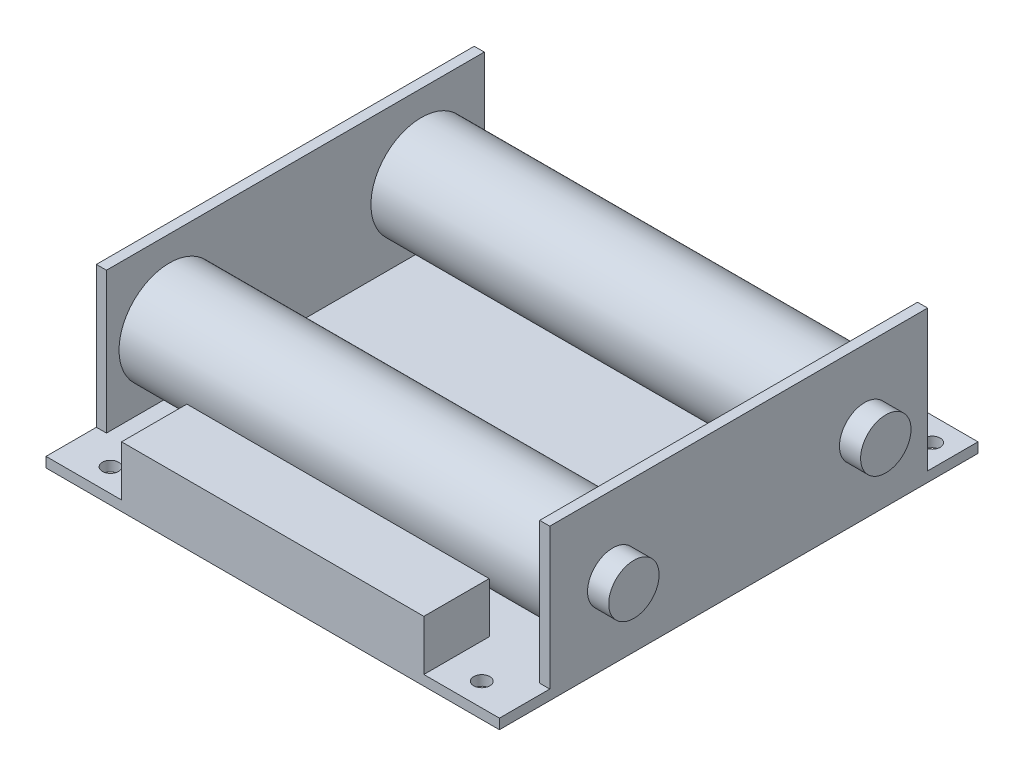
ISO-10303-21;
HEADER;
FILE_DESCRIPTION(('STEP AP214'),'2;1');
FILE_NAME('part.step','',(''),(''),'','','');
FILE_SCHEMA(('AUTOMOTIVE_DESIGN { 1 0 10303 214 1 1 1 1 }'));
ENDSEC;
DATA;
#1=APPLICATION_CONTEXT('core data for automotive mechanical design processes');
#2=APPLICATION_PROTOCOL_DEFINITION('international standard','automotive_design',2000,#1);
#3=PRODUCT_CONTEXT('',#1,'mechanical');
#4=PRODUCT('Part','Part','',(#3));
#5=PRODUCT_RELATED_PRODUCT_CATEGORY('part','',(#4));
#6=PRODUCT_DEFINITION_FORMATION('','',#4);
#7=PRODUCT_DEFINITION_CONTEXT('part definition',#1,'design');
#8=PRODUCT_DEFINITION('design','',#6,#7);
#9=PRODUCT_DEFINITION_SHAPE('','',#8);
#10=(LENGTH_UNIT() NAMED_UNIT(*) SI_UNIT(.MILLI.,.METRE.));
#11=(NAMED_UNIT(*) PLANE_ANGLE_UNIT() SI_UNIT($,.RADIAN.));
#12=(NAMED_UNIT(*) SI_UNIT($,.STERADIAN.) SOLID_ANGLE_UNIT());
#13=UNCERTAINTY_MEASURE_WITH_UNIT(LENGTH_MEASURE(1.E-05),#10,'distance_accuracy_value','');
#14=(GEOMETRIC_REPRESENTATION_CONTEXT(3) GLOBAL_UNCERTAINTY_ASSIGNED_CONTEXT((#13)) GLOBAL_UNIT_ASSIGNED_CONTEXT((#10,
#11,#12)) REPRESENTATION_CONTEXT('',''));
#15=CARTESIAN_POINT('',(0.,0.,0.));
#16=DIRECTION('',(0.,0.,1.));
#17=DIRECTION('',(1.,0.,0.));
#18=AXIS2_PLACEMENT_3D('',#15,#16,#17);
#19=CARTESIAN_POINT('',(-49.2,15.,25.));
#20=DIRECTION('',(1.,0.,0.));
#21=DIRECTION('',(0.,0.,-1.));
#22=AXIS2_PLACEMENT_3D('',#19,#20,#21);
#23=CYLINDRICAL_SURFACE('',#22,10.);
#24=CARTESIAN_POINT('',(43.,15.,25.));
#25=DIRECTION('',(1.,0.,0.));
#26=DIRECTION('',(0.,0.,-1.));
#27=AXIS2_PLACEMENT_3D('',#24,#25,#26);
#28=CIRCLE('',#27,10.);
#29=CARTESIAN_POINT('',(43.,15.,15.));
#30=VERTEX_POINT('',#29);
#31=EDGE_CURVE('E11',#30,#30,#28,.F.);
#32=ORIENTED_EDGE('',*,*,#31,.T.);
#33=EDGE_LOOP('',(#32));
#34=FACE_BOUND('',#33,.T.);
#35=CARTESIAN_POINT('',(-43.,15.,25.));
#36=DIRECTION('',(1.,0.,0.));
#37=DIRECTION('',(0.,0.,-1.));
#38=AXIS2_PLACEMENT_3D('',#35,#36,#37);
#39=CIRCLE('',#38,10.);
#40=CARTESIAN_POINT('',(-43.,15.,15.));
#41=VERTEX_POINT('',#40);
#42=EDGE_CURVE('E47',#41,#41,#39,.T.);
#43=ORIENTED_EDGE('',*,*,#42,.T.);
#44=EDGE_LOOP('',(#43));
#45=FACE_BOUND('',#44,.T.);
#46=ADVANCED_FACE('F46',(#34,#45),#23,.T.);
#47=OPEN_SHELL('',(#46));
#48=SHELL_BASED_SURFACE_MODEL('B2',(#47));
#49=CARTESIAN_POINT('',(-49.2,15.,-25.));
#50=DIRECTION('',(1.,0.,0.));
#51=DIRECTION('',(0.,0.,-1.));
#52=AXIS2_PLACEMENT_3D('',#49,#50,#51);
#53=CYLINDRICAL_SURFACE('',#52,10.);
#54=CARTESIAN_POINT('',(43.,15.,-25.));
#55=DIRECTION('',(1.,0.,0.));
#56=DIRECTION('',(0.,0.,-1.));
#57=AXIS2_PLACEMENT_3D('',#54,#55,#56);
#58=CIRCLE('',#57,10.);
#59=CARTESIAN_POINT('',(43.,15.,-35.));
#60=VERTEX_POINT('',#59);
#61=EDGE_CURVE('E86',#60,#60,#58,.F.);
#62=ORIENTED_EDGE('',*,*,#61,.T.);
#63=EDGE_LOOP('',(#62));
#64=FACE_BOUND('',#63,.T.);
#65=CARTESIAN_POINT('',(-43.,15.,-25.));
#66=DIRECTION('',(1.,0.,0.));
#67=DIRECTION('',(0.,0.,-1.));
#68=AXIS2_PLACEMENT_3D('',#65,#66,#67);
#69=CIRCLE('',#68,10.);
#70=CARTESIAN_POINT('',(-43.,15.,-35.));
#71=VERTEX_POINT('',#70);
#72=EDGE_CURVE('E45',#71,#71,#69,.T.);
#73=ORIENTED_EDGE('',*,*,#72,.T.);
#74=EDGE_LOOP('',(#73));
#75=FACE_BOUND('',#74,.T.);
#76=ADVANCED_FACE('F82',(#64,#75),#53,.T.);
#77=OPEN_SHELL('',(#76));
#78=SHELL_BASED_SURFACE_MODEL('B6',(#77));
#79=CARTESIAN_POINT('',(0.,2.,0.));
#80=DIRECTION('',(0.,-1.,0.));
#81=DIRECTION('',(0.,0.,-1.));
#82=AXIS2_PLACEMENT_3D('',#79,#80,#81);
#83=PLANE('',#82);
#84=CARTESIAN_POINT('',(-36.8,2.,42.9));
#85=DIRECTION('',(0.,-1.,0.));
#86=DIRECTION('',(0.,0.,-1.));
#87=AXIS2_PLACEMENT_3D('',#84,#85,#86);
#88=CIRCLE('',#87,1.6);
#89=CARTESIAN_POINT('',(-36.8,2.,41.3));
#90=VERTEX_POINT('',#89);
#91=EDGE_CURVE('E336',#90,#90,#88,.T.);
#92=ORIENTED_EDGE('',*,*,#91,.T.);
#93=EDGE_LOOP('',(#92));
#94=FACE_BOUND('',#93,.T.);
#95=CARTESIAN_POINT('',(36.9,2.,42.9));
#96=DIRECTION('',(0.,-1.,0.));
#97=DIRECTION('',(0.,0.,-1.));
#98=AXIS2_PLACEMENT_3D('',#95,#96,#97);
#99=CIRCLE('',#98,1.6);
#100=CARTESIAN_POINT('',(36.9,2.,41.3));
#101=VERTEX_POINT('',#100);
#102=EDGE_CURVE('E342',#101,#101,#99,.T.);
#103=ORIENTED_EDGE('',*,*,#102,.T.);
#104=EDGE_LOOP('',(#103));
#105=FACE_BOUND('',#104,.T.);
#106=CARTESIAN_POINT('',(40.6,2.,-42.8));
#107=DIRECTION('',(0.,-1.,0.));
#108=DIRECTION('',(0.,0.,-1.));
#109=AXIS2_PLACEMENT_3D('',#106,#107,#108);
#110=CIRCLE('',#109,1.6);
#111=CARTESIAN_POINT('',(40.6,2.,-44.4));
#112=VERTEX_POINT('',#111);
#113=EDGE_CURVE('E348',#112,#112,#110,.T.);
#114=ORIENTED_EDGE('',*,*,#113,.T.);
#115=EDGE_LOOP('',(#114));
#116=FACE_BOUND('',#115,.T.);
#117=CARTESIAN_POINT('',(-39.4,2.,-42.8));
#118=DIRECTION('',(0.,-1.,0.));
#119=DIRECTION('',(0.,0.,-1.));
#120=AXIS2_PLACEMENT_3D('',#117,#118,#119);
#121=CIRCLE('',#120,1.6);
#122=CARTESIAN_POINT('',(-39.4,2.,-44.4));
#123=VERTEX_POINT('',#122);
#124=EDGE_CURVE('E354',#123,#123,#121,.T.);
#125=ORIENTED_EDGE('',*,*,#124,.T.);
#126=EDGE_LOOP('',(#125));
#127=FACE_BOUND('',#126,.T.);
#128=DIRECTION('',(0.,0.,1.));
#129=VECTOR('',#128,1.);
#130=CARTESIAN_POINT('',(-30.,2.,34.5));
#131=LINE('',#130,#129);
#132=CARTESIAN_POINT('',(-30.,2.,34.5));
#133=VERTEX_POINT('',#132);
#134=CARTESIAN_POINT('',(-30.,2.,47.5));
#135=VERTEX_POINT('',#134);
#136=EDGE_CURVE('E125',#133,#135,#131,.T.);
#137=ORIENTED_EDGE('',*,*,#136,.F.);
#138=DIRECTION('',(-1.,0.,0.));
#139=VECTOR('',#138,1.);
#140=CARTESIAN_POINT('',(-30.,2.,34.5));
#141=LINE('',#140,#139);
#142=CARTESIAN_POINT('',(30.,2.,34.5));
#143=VERTEX_POINT('',#142);
#144=EDGE_CURVE('E129',#143,#133,#141,.T.);
#145=ORIENTED_EDGE('',*,*,#144,.F.);
#146=DIRECTION('',(0.,0.,-1.));
#147=VECTOR('',#146,1.);
#148=CARTESIAN_POINT('',(30.,2.,34.5));
#149=LINE('',#148,#147);
#150=CARTESIAN_POINT('',(30.,2.,47.5));
#151=VERTEX_POINT('',#150);
#152=EDGE_CURVE('E760',#151,#143,#149,.T.);
#153=ORIENTED_EDGE('',*,*,#152,.F.);
#154=DIRECTION('',(1.,0.,0.));
#155=VECTOR('',#154,1.);
#156=CARTESIAN_POINT('',(45.,2.,47.5));
#157=LINE('',#156,#155);
#158=CARTESIAN_POINT('',(45.,2.,47.5));
#159=VERTEX_POINT('',#158);
#160=EDGE_CURVE('E360',#151,#159,#157,.T.);
#161=ORIENTED_EDGE('',*,*,#160,.T.);
#162=DIRECTION('',(0.,0.,-1.));
#163=VECTOR('',#162,1.);
#164=CARTESIAN_POINT('',(45.,2.,-47.5));
#165=LINE('',#164,#163);
#166=CARTESIAN_POINT('',(45.,2.,37.5));
#167=VERTEX_POINT('',#166);
#168=EDGE_CURVE('E365',#159,#167,#165,.T.);
#169=ORIENTED_EDGE('',*,*,#168,.T.);
#170=DIRECTION('',(-1.,0.,0.));
#171=VECTOR('',#170,1.);
#172=CARTESIAN_POINT('',(0.,2.,37.5));
#173=LINE('',#172,#171);
#174=CARTESIAN_POINT('',(43.,2.,37.5));
#175=VERTEX_POINT('',#174);
#176=EDGE_CURVE('E331',#167,#175,#173,.T.);
#177=ORIENTED_EDGE('',*,*,#176,.T.);
#178=DIRECTION('',(0.,0.,-1.));
#179=VECTOR('',#178,1.);
#180=CARTESIAN_POINT('',(43.,2.,0.));
#181=LINE('',#180,#179);
#182=CARTESIAN_POINT('',(43.,2.,-37.5));
#183=VERTEX_POINT('',#182);
#184=EDGE_CURVE('E324',#175,#183,#181,.T.);
#185=ORIENTED_EDGE('',*,*,#184,.T.);
#186=DIRECTION('',(1.,0.,0.));
#187=VECTOR('',#186,1.);
#188=CARTESIAN_POINT('',(0.,2.,-37.5));
#189=LINE('',#188,#187);
#190=CARTESIAN_POINT('',(45.,2.,-37.5));
#191=VERTEX_POINT('',#190);
#192=EDGE_CURVE('E328',#183,#191,#189,.T.);
#193=ORIENTED_EDGE('',*,*,#192,.T.);
#194=CARTESIAN_POINT('',(45.,2.,-47.5));
#195=VERTEX_POINT('',#194);
#196=EDGE_CURVE('E364',#191,#195,#165,.T.);
#197=ORIENTED_EDGE('',*,*,#196,.T.);
#198=DIRECTION('',(-1.,0.,0.));
#199=VECTOR('',#198,1.);
#200=CARTESIAN_POINT('',(45.,2.,-47.5));
#201=LINE('',#200,#199);
#202=CARTESIAN_POINT('',(-45.,2.,-47.5));
#203=VERTEX_POINT('',#202);
#204=EDGE_CURVE('E367',#195,#203,#201,.T.);
#205=ORIENTED_EDGE('',*,*,#204,.T.);
#206=DIRECTION('',(0.,0.,1.));
#207=VECTOR('',#206,1.);
#208=CARTESIAN_POINT('',(-45.,2.,-47.5));
#209=LINE('',#208,#207);
#210=CARTESIAN_POINT('',(-45.,2.,-37.5));
#211=VERTEX_POINT('',#210);
#212=EDGE_CURVE('E358',#203,#211,#209,.T.);
#213=ORIENTED_EDGE('',*,*,#212,.T.);
#214=DIRECTION('',(-1.,0.,0.));
#215=VECTOR('',#214,1.);
#216=CARTESIAN_POINT('',(0.,2.,-37.5));
#217=LINE('',#216,#215);
#218=CARTESIAN_POINT('',(-43.,2.,-37.5));
#219=VERTEX_POINT('',#218);
#220=EDGE_CURVE('E299',#219,#211,#217,.T.);
#221=ORIENTED_EDGE('',*,*,#220,.F.);
#222=DIRECTION('',(0.,0.,1.));
#223=VECTOR('',#222,1.);
#224=CARTESIAN_POINT('',(-43.,2.,0.));
#225=LINE('',#224,#223);
#226=CARTESIAN_POINT('',(-43.,2.,37.5));
#227=VERTEX_POINT('',#226);
#228=EDGE_CURVE('E295',#219,#227,#225,.T.);
#229=ORIENTED_EDGE('',*,*,#228,.T.);
#230=DIRECTION('',(1.,0.,0.));
#231=VECTOR('',#230,1.);
#232=CARTESIAN_POINT('',(0.,2.,37.5));
#233=LINE('',#232,#231);
#234=CARTESIAN_POINT('',(-45.,2.,37.5));
#235=VERTEX_POINT('',#234);
#236=EDGE_CURVE('E302',#235,#227,#233,.T.);
#237=ORIENTED_EDGE('',*,*,#236,.F.);
#238=CARTESIAN_POINT('',(-45.,2.,47.5));
#239=VERTEX_POINT('',#238);
#240=EDGE_CURVE('E361',#235,#239,#209,.T.);
#241=ORIENTED_EDGE('',*,*,#240,.T.);
#242=EDGE_CURVE('E362',#239,#135,#157,.T.);
#243=ORIENTED_EDGE('',*,*,#242,.T.);
#244=EDGE_LOOP('',(#137,#145,#153,#161,#169,#177,#185,#193,#197,#205,#213,#221,#229,#237,#241,#243));
#245=FACE_BOUND('',#244,.T.);
#246=ADVANCED_FACE('F109',(#94,#105,#116,#127,#245),#83,.F.);
#247=CARTESIAN_POINT('',(-45.,2.,-47.5));
#248=DIRECTION('',(1.,0.,0.));
#249=DIRECTION('',(0.,0.,-1.));
#250=AXIS2_PLACEMENT_3D('',#247,#248,#249);
#251=PLANE('',#250);
#252=CARTESIAN_POINT('',(-45.,15.,-25.));
#253=DIRECTION('',(1.,0.,0.));
#254=DIRECTION('',(0.,0.,-1.));
#255=AXIS2_PLACEMENT_3D('',#252,#253,#254);
#256=CIRCLE('',#255,5.);
#257=CARTESIAN_POINT('',(-45.,15.,-30.));
#258=VERTEX_POINT('',#257);
#259=EDGE_CURVE('E258',#258,#258,#256,.T.);
#260=ORIENTED_EDGE('',*,*,#259,.T.);
#261=EDGE_LOOP('',(#260));
#262=FACE_BOUND('',#261,.T.);
#263=CARTESIAN_POINT('',(-45.,15.,25.));
#264=DIRECTION('',(1.,0.,0.));
#265=DIRECTION('',(0.,0.,-1.));
#266=AXIS2_PLACEMENT_3D('',#263,#264,#265);
#267=CIRCLE('',#266,5.);
#268=CARTESIAN_POINT('',(-45.,15.,20.));
#269=VERTEX_POINT('',#268);
#270=EDGE_CURVE('E274',#269,#269,#267,.T.);
#271=ORIENTED_EDGE('',*,*,#270,.T.);
#272=EDGE_LOOP('',(#271));
#273=FACE_BOUND('',#272,.T.);
#274=DIRECTION('',(0.,0.,1.));
#275=VECTOR('',#274,1.);
#276=CARTESIAN_POINT('',(-45.,0.,-47.5));
#277=LINE('',#276,#275);
#278=CARTESIAN_POINT('',(-45.,0.,-47.5));
#279=VERTEX_POINT('',#278);
#280=CARTESIAN_POINT('',(-45.,0.,47.5));
#281=VERTEX_POINT('',#280);
#282=EDGE_CURVE('E357',#279,#281,#277,.T.);
#283=ORIENTED_EDGE('',*,*,#282,.T.);
#284=DIRECTION('',(0.,-1.,0.));
#285=VECTOR('',#284,1.);
#286=CARTESIAN_POINT('',(-45.,2.,47.5));
#287=LINE('',#286,#285);
#288=EDGE_CURVE('E385',#239,#281,#287,.T.);
#289=ORIENTED_EDGE('',*,*,#288,.F.);
#290=ORIENTED_EDGE('',*,*,#240,.F.);
#291=DIRECTION('',(0.,-1.,0.));
#292=VECTOR('',#291,1.);
#293=CARTESIAN_POINT('',(-45.,0.,37.5));
#294=LINE('',#293,#292);
#295=CARTESIAN_POINT('',(-45.,30.,37.5));
#296=VERTEX_POINT('',#295);
#297=EDGE_CURVE('E277',#296,#235,#294,.T.);
#298=ORIENTED_EDGE('',*,*,#297,.F.);
#299=DIRECTION('',(0.,0.,1.));
#300=VECTOR('',#299,1.);
#301=CARTESIAN_POINT('',(-45.,30.,37.5));
#302=LINE('',#301,#300);
#303=CARTESIAN_POINT('',(-45.,30.,-37.5));
#304=VERTEX_POINT('',#303);
#305=EDGE_CURVE('E289',#304,#296,#302,.T.);
#306=ORIENTED_EDGE('',*,*,#305,.F.);
#307=DIRECTION('',(0.,1.,0.));
#308=VECTOR('',#307,1.);
#309=CARTESIAN_POINT('',(-45.,0.,-37.5));
#310=LINE('',#309,#308);
#311=EDGE_CURVE('E282',#211,#304,#310,.T.);
#312=ORIENTED_EDGE('',*,*,#311,.F.);
#313=ORIENTED_EDGE('',*,*,#212,.F.);
#314=DIRECTION('',(0.,-1.,0.));
#315=VECTOR('',#314,1.);
#316=CARTESIAN_POINT('',(-45.,2.,-47.5));
#317=LINE('',#316,#315);
#318=EDGE_CURVE('E369',#203,#279,#317,.T.);
#319=ORIENTED_EDGE('',*,*,#318,.T.);
#320=EDGE_LOOP('',(#283,#289,#290,#298,#306,#312,#313,#319));
#321=FACE_BOUND('',#320,.T.);
#322=ADVANCED_FACE('F111',(#262,#273,#321),#251,.F.);
#323=CARTESIAN_POINT('',(45.,2.,47.5));
#324=DIRECTION('',(0.,0.,-1.));
#325=DIRECTION('',(-1.,0.,0.));
#326=AXIS2_PLACEMENT_3D('',#323,#324,#325);
#327=PLANE('',#326);
#328=DIRECTION('',(1.,0.,0.));
#329=VECTOR('',#328,1.);
#330=CARTESIAN_POINT('',(45.,0.,47.5));
#331=LINE('',#330,#329);
#332=CARTESIAN_POINT('',(45.,0.,47.5));
#333=VERTEX_POINT('',#332);
#334=EDGE_CURVE('E371',#281,#333,#331,.T.);
#335=ORIENTED_EDGE('',*,*,#334,.T.);
#336=DIRECTION('',(0.,-1.,0.));
#337=VECTOR('',#336,1.);
#338=CARTESIAN_POINT('',(45.,2.,47.5));
#339=LINE('',#338,#337);
#340=EDGE_CURVE('E382',#159,#333,#339,.T.);
#341=ORIENTED_EDGE('',*,*,#340,.F.);
#342=ORIENTED_EDGE('',*,*,#160,.F.);
#343=DIRECTION('',(0.,-1.,0.));
#344=VECTOR('',#343,1.);
#345=CARTESIAN_POINT('',(30.,12.,47.5));
#346=LINE('',#345,#344);
#347=CARTESIAN_POINT('',(30.,12.,47.5));
#348=VERTEX_POINT('',#347);
#349=EDGE_CURVE('E229',#348,#151,#346,.T.);
#350=ORIENTED_EDGE('',*,*,#349,.F.);
#351=DIRECTION('',(1.,0.,0.));
#352=VECTOR('',#351,1.);
#353=CARTESIAN_POINT('',(-30.,12.,47.5));
#354=LINE('',#353,#352);
#355=CARTESIAN_POINT('',(-30.,12.,47.5));
#356=VERTEX_POINT('',#355);
#357=EDGE_CURVE('E222',#356,#348,#354,.T.);
#358=ORIENTED_EDGE('',*,*,#357,.F.);
#359=DIRECTION('',(0.,-1.,0.));
#360=VECTOR('',#359,1.);
#361=CARTESIAN_POINT('',(-30.,12.,47.5));
#362=LINE('',#361,#360);
#363=EDGE_CURVE('E227',#356,#135,#362,.T.);
#364=ORIENTED_EDGE('',*,*,#363,.T.);
#365=ORIENTED_EDGE('',*,*,#242,.F.);
#366=ORIENTED_EDGE('',*,*,#288,.T.);
#367=EDGE_LOOP('',(#335,#341,#342,#350,#358,#364,#365,#366));
#368=FACE_BOUND('',#367,.T.);
#369=ADVANCED_FACE('F224',(#368),#327,.F.);
#370=CARTESIAN_POINT('',(45.,2.,-47.5));
#371=DIRECTION('',(-1.,0.,0.));
#372=DIRECTION('',(0.,0.,1.));
#373=AXIS2_PLACEMENT_3D('',#370,#371,#372);
#374=PLANE('',#373);
#375=CARTESIAN_POINT('',(45.,15.,-25.));
#376=DIRECTION('',(-1.,0.,0.));
#377=DIRECTION('',(0.,0.,1.));
#378=AXIS2_PLACEMENT_3D('',#375,#376,#377);
#379=CIRCLE('',#378,5.);
#380=CARTESIAN_POINT('',(45.,15.,-20.));
#381=VERTEX_POINT('',#380);
#382=EDGE_CURVE('E254',#381,#381,#379,.T.);
#383=ORIENTED_EDGE('',*,*,#382,.T.);
#384=EDGE_LOOP('',(#383));
#385=FACE_BOUND('',#384,.T.);
#386=CARTESIAN_POINT('',(45.,15.,25.));
#387=DIRECTION('',(-1.,0.,0.));
#388=DIRECTION('',(0.,0.,1.));
#389=AXIS2_PLACEMENT_3D('',#386,#387,#388);
#390=CIRCLE('',#389,5.);
#391=CARTESIAN_POINT('',(45.,15.,30.));
#392=VERTEX_POINT('',#391);
#393=EDGE_CURVE('E267',#392,#392,#390,.T.);
#394=ORIENTED_EDGE('',*,*,#393,.T.);
#395=EDGE_LOOP('',(#394));
#396=FACE_BOUND('',#395,.T.);
#397=ORIENTED_EDGE('',*,*,#196,.F.);
#398=DIRECTION('',(0.,1.,0.));
#399=VECTOR('',#398,1.);
#400=CARTESIAN_POINT('',(45.,0.,-37.5));
#401=LINE('',#400,#399);
#402=CARTESIAN_POINT('',(45.,30.,-37.5));
#403=VERTEX_POINT('',#402);
#404=EDGE_CURVE('E318',#191,#403,#401,.T.);
#405=ORIENTED_EDGE('',*,*,#404,.T.);
#406=DIRECTION('',(0.,0.,1.));
#407=VECTOR('',#406,1.);
#408=CARTESIAN_POINT('',(45.,30.,37.5));
#409=LINE('',#408,#407);
#410=CARTESIAN_POINT('',(45.,30.,37.5));
#411=VERTEX_POINT('',#410);
#412=EDGE_CURVE('E310',#403,#411,#409,.T.);
#413=ORIENTED_EDGE('',*,*,#412,.T.);
#414=DIRECTION('',(0.,-1.,0.));
#415=VECTOR('',#414,1.);
#416=CARTESIAN_POINT('',(45.,0.,37.5));
#417=LINE('',#416,#415);
#418=EDGE_CURVE('E305',#411,#167,#417,.T.);
#419=ORIENTED_EDGE('',*,*,#418,.T.);
#420=ORIENTED_EDGE('',*,*,#168,.F.);
#421=ORIENTED_EDGE('',*,*,#340,.T.);
#422=DIRECTION('',(0.,0.,-1.));
#423=VECTOR('',#422,1.);
#424=CARTESIAN_POINT('',(45.,0.,-47.5));
#425=LINE('',#424,#423);
#426=CARTESIAN_POINT('',(45.,0.,-47.5));
#427=VERTEX_POINT('',#426);
#428=EDGE_CURVE('E373',#333,#427,#425,.T.);
#429=ORIENTED_EDGE('',*,*,#428,.T.);
#430=DIRECTION('',(0.,-1.,0.));
#431=VECTOR('',#430,1.);
#432=CARTESIAN_POINT('',(45.,2.,-47.5));
#433=LINE('',#432,#431);
#434=EDGE_CURVE('E379',#195,#427,#433,.T.);
#435=ORIENTED_EDGE('',*,*,#434,.F.);
#436=EDGE_LOOP('',(#397,#405,#413,#419,#420,#421,#429,#435));
#437=FACE_BOUND('',#436,.T.);
#438=ADVANCED_FACE('F427',(#385,#396,#437),#374,.F.);
#439=CARTESIAN_POINT('',(45.,2.,-47.5));
#440=DIRECTION('',(0.,0.,1.));
#441=DIRECTION('',(1.,0.,0.));
#442=AXIS2_PLACEMENT_3D('',#439,#440,#441);
#443=PLANE('',#442);
#444=DIRECTION('',(-1.,0.,0.));
#445=VECTOR('',#444,1.);
#446=CARTESIAN_POINT('',(45.,0.,-47.5));
#447=LINE('',#446,#445);
#448=EDGE_CURVE('E375',#427,#279,#447,.T.);
#449=ORIENTED_EDGE('',*,*,#448,.T.);
#450=ORIENTED_EDGE('',*,*,#318,.F.);
#451=ORIENTED_EDGE('',*,*,#204,.F.);
#452=ORIENTED_EDGE('',*,*,#434,.T.);
#453=EDGE_LOOP('',(#449,#450,#451,#452));
#454=FACE_BOUND('',#453,.T.);
#455=ADVANCED_FACE('F449',(#454),#443,.F.);
#456=CARTESIAN_POINT('',(0.,0.,0.));
#457=DIRECTION('',(0.,-1.,0.));
#458=DIRECTION('',(0.,0.,-1.));
#459=AXIS2_PLACEMENT_3D('',#456,#457,#458);
#460=PLANE('',#459);
#461=ORIENTED_EDGE('',*,*,#334,.F.);
#462=ORIENTED_EDGE('',*,*,#282,.F.);
#463=ORIENTED_EDGE('',*,*,#448,.F.);
#464=ORIENTED_EDGE('',*,*,#428,.F.);
#465=EDGE_LOOP('',(#461,#462,#463,#464));
#466=FACE_BOUND('',#465,.T.);
#467=CARTESIAN_POINT('',(-39.4,0.,-42.8));
#468=DIRECTION('',(0.,-1.,0.));
#469=DIRECTION('',(0.,0.,-1.));
#470=AXIS2_PLACEMENT_3D('',#467,#468,#469);
#471=CIRCLE('',#470,1.59999999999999);
#472=CARTESIAN_POINT('',(-39.4,0.,-44.4));
#473=VERTEX_POINT('',#472);
#474=EDGE_CURVE('E351',#473,#473,#471,.T.);
#475=ORIENTED_EDGE('',*,*,#474,.F.);
#476=EDGE_LOOP('',(#475));
#477=FACE_BOUND('',#476,.T.);
#478=CARTESIAN_POINT('',(40.6,0.,-42.8));
#479=DIRECTION('',(0.,-1.,0.));
#480=DIRECTION('',(0.,0.,-1.));
#481=AXIS2_PLACEMENT_3D('',#478,#479,#480);
#482=CIRCLE('',#481,1.59999999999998);
#483=CARTESIAN_POINT('',(40.6,0.,-44.4));
#484=VERTEX_POINT('',#483);
#485=EDGE_CURVE('E345',#484,#484,#482,.T.);
#486=ORIENTED_EDGE('',*,*,#485,.F.);
#487=EDGE_LOOP('',(#486));
#488=FACE_BOUND('',#487,.T.);
#489=CARTESIAN_POINT('',(36.9,0.,42.9));
#490=DIRECTION('',(0.,-1.,0.));
#491=DIRECTION('',(0.,0.,-1.));
#492=AXIS2_PLACEMENT_3D('',#489,#490,#491);
#493=CIRCLE('',#492,1.59999999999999);
#494=CARTESIAN_POINT('',(36.9,0.,41.3));
#495=VERTEX_POINT('',#494);
#496=EDGE_CURVE('E339',#495,#495,#493,.T.);
#497=ORIENTED_EDGE('',*,*,#496,.F.);
#498=EDGE_LOOP('',(#497));
#499=FACE_BOUND('',#498,.T.);
#500=CARTESIAN_POINT('',(-36.8,0.,42.9));
#501=DIRECTION('',(0.,-1.,0.));
#502=DIRECTION('',(0.,0.,-1.));
#503=AXIS2_PLACEMENT_3D('',#500,#501,#502);
#504=CIRCLE('',#503,1.59999999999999);
#505=CARTESIAN_POINT('',(-36.8,0.,41.3));
#506=VERTEX_POINT('',#505);
#507=EDGE_CURVE('E333',#506,#506,#504,.T.);
#508=ORIENTED_EDGE('',*,*,#507,.F.);
#509=EDGE_LOOP('',(#508));
#510=FACE_BOUND('',#509,.T.);
#511=ADVANCED_FACE('F422',(#466,#477,#488,#499,#510),#460,.T.);
#512=CARTESIAN_POINT('',(-39.4,0.,-42.8));
#513=DIRECTION('',(0.,-1.,0.));
#514=DIRECTION('',(0.,0.,-1.));
#515=AXIS2_PLACEMENT_3D('',#512,#513,#514);
#516=CYLINDRICAL_SURFACE('',#515,1.59999999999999);
#517=ORIENTED_EDGE('',*,*,#124,.F.);
#518=EDGE_LOOP('',(#517));
#519=FACE_BOUND('',#518,.T.);
#520=ORIENTED_EDGE('',*,*,#474,.T.);
#521=EDGE_LOOP('',(#520));
#522=FACE_BOUND('',#521,.T.);
#523=ADVANCED_FACE('F456',(#519,#522),#516,.F.);
#524=CARTESIAN_POINT('',(40.6,0.,-42.8));
#525=DIRECTION('',(0.,-1.,0.));
#526=DIRECTION('',(0.,0.,-1.));
#527=AXIS2_PLACEMENT_3D('',#524,#525,#526);
#528=CYLINDRICAL_SURFACE('',#527,1.59999999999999);
#529=ORIENTED_EDGE('',*,*,#113,.F.);
#530=EDGE_LOOP('',(#529));
#531=FACE_BOUND('',#530,.T.);
#532=ORIENTED_EDGE('',*,*,#485,.T.);
#533=EDGE_LOOP('',(#532));
#534=FACE_BOUND('',#533,.T.);
#535=ADVANCED_FACE('F471',(#531,#534),#528,.F.);
#536=CARTESIAN_POINT('',(36.9,0.,42.9));
#537=DIRECTION('',(0.,-1.,0.));
#538=DIRECTION('',(0.,0.,-1.));
#539=AXIS2_PLACEMENT_3D('',#536,#537,#538);
#540=CYLINDRICAL_SURFACE('',#539,1.59999999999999);
#541=ORIENTED_EDGE('',*,*,#102,.F.);
#542=EDGE_LOOP('',(#541));
#543=FACE_BOUND('',#542,.T.);
#544=ORIENTED_EDGE('',*,*,#496,.T.);
#545=EDGE_LOOP('',(#544));
#546=FACE_BOUND('',#545,.T.);
#547=ADVANCED_FACE('F475',(#543,#546),#540,.F.);
#548=CARTESIAN_POINT('',(-36.8,0.,42.9));
#549=DIRECTION('',(0.,-1.,0.));
#550=DIRECTION('',(0.,0.,-1.));
#551=AXIS2_PLACEMENT_3D('',#548,#549,#550);
#552=CYLINDRICAL_SURFACE('',#551,1.59999999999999);
#553=ORIENTED_EDGE('',*,*,#91,.F.);
#554=EDGE_LOOP('',(#553));
#555=FACE_BOUND('',#554,.T.);
#556=ORIENTED_EDGE('',*,*,#507,.T.);
#557=EDGE_LOOP('',(#556));
#558=FACE_BOUND('',#557,.T.);
#559=ADVANCED_FACE('F479',(#555,#558),#552,.F.);
#560=CARTESIAN_POINT('',(43.,0.,37.5));
#561=DIRECTION('',(0.,0.,1.));
#562=DIRECTION('',(1.,0.,0.));
#563=AXIS2_PLACEMENT_3D('',#560,#561,#562);
#564=PLANE('',#563);
#565=ORIENTED_EDGE('',*,*,#176,.F.);
#566=ORIENTED_EDGE('',*,*,#418,.F.);
#567=DIRECTION('',(1.,0.,0.));
#568=VECTOR('',#567,1.);
#569=CARTESIAN_POINT('',(43.,30.,37.5));
#570=LINE('',#569,#568);
#571=CARTESIAN_POINT('',(43.,30.,37.5));
#572=VERTEX_POINT('',#571);
#573=EDGE_CURVE('E322',#572,#411,#570,.T.);
#574=ORIENTED_EDGE('',*,*,#573,.F.);
#575=DIRECTION('',(0.,-1.,0.));
#576=VECTOR('',#575,1.);
#577=CARTESIAN_POINT('',(43.,0.,37.5));
#578=LINE('',#577,#576);
#579=EDGE_CURVE('E306',#572,#175,#578,.T.);
#580=ORIENTED_EDGE('',*,*,#579,.T.);
#581=EDGE_LOOP('',(#565,#566,#574,#580));
#582=FACE_BOUND('',#581,.T.);
#583=ADVANCED_FACE('F433',(#582),#564,.T.);
#584=CARTESIAN_POINT('',(43.,0.,-37.5));
#585=DIRECTION('',(0.,0.,-1.));
#586=DIRECTION('',(-1.,0.,0.));
#587=AXIS2_PLACEMENT_3D('',#584,#585,#586);
#588=PLANE('',#587);
#589=ORIENTED_EDGE('',*,*,#192,.F.);
#590=DIRECTION('',(0.,1.,0.));
#591=VECTOR('',#590,1.);
#592=CARTESIAN_POINT('',(43.,0.,-37.5));
#593=LINE('',#592,#591);
#594=CARTESIAN_POINT('',(43.,30.,-37.5));
#595=VERTEX_POINT('',#594);
#596=EDGE_CURVE('E309',#183,#595,#593,.T.);
#597=ORIENTED_EDGE('',*,*,#596,.T.);
#598=DIRECTION('',(1.,0.,0.));
#599=VECTOR('',#598,1.);
#600=CARTESIAN_POINT('',(43.,30.,-37.5));
#601=LINE('',#600,#599);
#602=EDGE_CURVE('E315',#595,#403,#601,.T.);
#603=ORIENTED_EDGE('',*,*,#602,.T.);
#604=ORIENTED_EDGE('',*,*,#404,.F.);
#605=EDGE_LOOP('',(#589,#597,#603,#604));
#606=FACE_BOUND('',#605,.T.);
#607=ADVANCED_FACE('F446',(#606),#588,.T.);
#608=CARTESIAN_POINT('',(43.,0.,0.));
#609=DIRECTION('',(-1.,0.,0.));
#610=DIRECTION('',(0.,0.,1.));
#611=AXIS2_PLACEMENT_3D('',#608,#609,#610);
#612=PLANE('',#611);
#613=CARTESIAN_POINT('',(43.,15.,-25.));
#614=DIRECTION('',(-1.,0.,0.));
#615=DIRECTION('',(0.,0.,1.));
#616=AXIS2_PLACEMENT_3D('',#613,#614,#615);
#617=CIRCLE('',#616,5.);
#618=CARTESIAN_POINT('',(43.,15.,-20.));
#619=VERTEX_POINT('',#618);
#620=EDGE_CURVE('E80',#619,#619,#617,.T.);
#621=ORIENTED_EDGE('',*,*,#620,.F.);
#622=EDGE_LOOP('',(#621));
#623=FACE_BOUND('',#622,.T.);
#624=CARTESIAN_POINT('',(43.,15.,25.));
#625=DIRECTION('',(-1.,0.,0.));
#626=DIRECTION('',(0.,0.,1.));
#627=AXIS2_PLACEMENT_3D('',#624,#625,#626);
#628=CIRCLE('',#627,5.);
#629=CARTESIAN_POINT('',(43.,15.,30.));
#630=VERTEX_POINT('',#629);
#631=EDGE_CURVE('E268',#630,#630,#628,.T.);
#632=ORIENTED_EDGE('',*,*,#631,.F.);
#633=EDGE_LOOP('',(#632));
#634=FACE_BOUND('',#633,.T.);
#635=ORIENTED_EDGE('',*,*,#184,.F.);
#636=ORIENTED_EDGE('',*,*,#579,.F.);
#637=DIRECTION('',(0.,0.,1.));
#638=VECTOR('',#637,1.);
#639=CARTESIAN_POINT('',(43.,30.,37.5));
#640=LINE('',#639,#638);
#641=EDGE_CURVE('E312',#595,#572,#640,.T.);
#642=ORIENTED_EDGE('',*,*,#641,.F.);
#643=ORIENTED_EDGE('',*,*,#596,.F.);
#644=EDGE_LOOP('',(#635,#636,#642,#643));
#645=FACE_BOUND('',#644,.T.);
#646=ADVANCED_FACE('F437',(#623,#634,#645),#612,.T.);
#647=CARTESIAN_POINT('',(43.,30.,37.5));
#648=DIRECTION('',(0.,1.,0.));
#649=DIRECTION('',(0.,0.,1.));
#650=AXIS2_PLACEMENT_3D('',#647,#648,#649);
#651=PLANE('',#650);
#652=ORIENTED_EDGE('',*,*,#412,.F.);
#653=ORIENTED_EDGE('',*,*,#602,.F.);
#654=ORIENTED_EDGE('',*,*,#641,.T.);
#655=ORIENTED_EDGE('',*,*,#573,.T.);
#656=EDGE_LOOP('',(#652,#653,#654,#655));
#657=FACE_BOUND('',#656,.T.);
#658=ADVANCED_FACE('F442',(#657),#651,.T.);
#659=CARTESIAN_POINT('',(-43.,0.,37.5));
#660=DIRECTION('',(0.,0.,-1.));
#661=DIRECTION('',(-1.,0.,0.));
#662=AXIS2_PLACEMENT_3D('',#659,#660,#661);
#663=PLANE('',#662);
#664=ORIENTED_EDGE('',*,*,#297,.T.);
#665=ORIENTED_EDGE('',*,*,#236,.T.);
#666=DIRECTION('',(0.,-1.,0.));
#667=VECTOR('',#666,1.);
#668=CARTESIAN_POINT('',(-43.,0.,37.5));
#669=LINE('',#668,#667);
#670=CARTESIAN_POINT('',(-43.,30.,37.5));
#671=VERTEX_POINT('',#670);
#672=EDGE_CURVE('E278',#671,#227,#669,.T.);
#673=ORIENTED_EDGE('',*,*,#672,.F.);
#674=DIRECTION('',(-1.,0.,0.));
#675=VECTOR('',#674,1.);
#676=CARTESIAN_POINT('',(-43.,30.,37.5));
#677=LINE('',#676,#675);
#678=EDGE_CURVE('E286',#671,#296,#677,.T.);
#679=ORIENTED_EDGE('',*,*,#678,.T.);
#680=EDGE_LOOP('',(#664,#665,#673,#679));
#681=FACE_BOUND('',#680,.T.);
#682=ADVANCED_FACE('F412',(#681),#663,.F.);
#683=CARTESIAN_POINT('',(-43.,0.,-37.5));
#684=DIRECTION('',(0.,0.,1.));
#685=DIRECTION('',(1.,0.,0.));
#686=AXIS2_PLACEMENT_3D('',#683,#684,#685);
#687=PLANE('',#686);
#688=DIRECTION('',(0.,1.,0.));
#689=VECTOR('',#688,1.);
#690=CARTESIAN_POINT('',(-43.,0.,-37.5));
#691=LINE('',#690,#689);
#692=CARTESIAN_POINT('',(-43.,30.,-37.5));
#693=VERTEX_POINT('',#692);
#694=EDGE_CURVE('E284',#219,#693,#691,.T.);
#695=ORIENTED_EDGE('',*,*,#694,.F.);
#696=ORIENTED_EDGE('',*,*,#220,.T.);
#697=ORIENTED_EDGE('',*,*,#311,.T.);
#698=DIRECTION('',(-1.,0.,0.));
#699=VECTOR('',#698,1.);
#700=CARTESIAN_POINT('',(-43.,30.,-37.5));
#701=LINE('',#700,#699);
#702=EDGE_CURVE('E292',#693,#304,#701,.T.);
#703=ORIENTED_EDGE('',*,*,#702,.F.);
#704=EDGE_LOOP('',(#695,#696,#697,#703));
#705=FACE_BOUND('',#704,.T.);
#706=ADVANCED_FACE('F396',(#705),#687,.F.);
#707=CARTESIAN_POINT('',(-43.,0.,0.));
#708=DIRECTION('',(1.,0.,0.));
#709=DIRECTION('',(0.,0.,1.));
#710=AXIS2_PLACEMENT_3D('',#707,#708,#709);
#711=PLANE('',#710);
#712=CARTESIAN_POINT('',(-43.,15.,-25.));
#713=DIRECTION('',(1.,0.,0.));
#714=DIRECTION('',(0.,0.,-1.));
#715=AXIS2_PLACEMENT_3D('',#712,#713,#714);
#716=CIRCLE('',#715,5.);
#717=CARTESIAN_POINT('',(-43.,15.,-30.));
#718=VERTEX_POINT('',#717);
#719=EDGE_CURVE('E113',#718,#718,#716,.T.);
#720=ORIENTED_EDGE('',*,*,#719,.F.);
#721=EDGE_LOOP('',(#720));
#722=FACE_BOUND('',#721,.T.);
#723=CARTESIAN_POINT('',(-43.,15.,25.));
#724=DIRECTION('',(1.,0.,0.));
#725=DIRECTION('',(0.,0.,-1.));
#726=AXIS2_PLACEMENT_3D('',#723,#724,#725);
#727=CIRCLE('',#726,5.);
#728=CARTESIAN_POINT('',(-43.,15.,20.));
#729=VERTEX_POINT('',#728);
#730=EDGE_CURVE('E271',#729,#729,#727,.T.);
#731=ORIENTED_EDGE('',*,*,#730,.F.);
#732=EDGE_LOOP('',(#731));
#733=FACE_BOUND('',#732,.T.);
#734=ORIENTED_EDGE('',*,*,#228,.F.);
#735=ORIENTED_EDGE('',*,*,#694,.T.);
#736=DIRECTION('',(0.,0.,1.));
#737=VECTOR('',#736,1.);
#738=CARTESIAN_POINT('',(-43.,30.,37.5));
#739=LINE('',#738,#737);
#740=EDGE_CURVE('E281',#693,#671,#739,.T.);
#741=ORIENTED_EDGE('',*,*,#740,.T.);
#742=ORIENTED_EDGE('',*,*,#672,.T.);
#743=EDGE_LOOP('',(#734,#735,#741,#742));
#744=FACE_BOUND('',#743,.T.);
#745=ADVANCED_FACE('F392',(#722,#733,#744),#711,.T.);
#746=CARTESIAN_POINT('',(-43.,30.,37.5));
#747=DIRECTION('',(0.,-1.,0.));
#748=DIRECTION('',(0.,0.,-1.));
#749=AXIS2_PLACEMENT_3D('',#746,#747,#748);
#750=PLANE('',#749);
#751=ORIENTED_EDGE('',*,*,#305,.T.);
#752=ORIENTED_EDGE('',*,*,#678,.F.);
#753=ORIENTED_EDGE('',*,*,#740,.F.);
#754=ORIENTED_EDGE('',*,*,#702,.T.);
#755=EDGE_LOOP('',(#751,#752,#753,#754));
#756=FACE_BOUND('',#755,.T.);
#757=ADVANCED_FACE('F395',(#756),#750,.F.);
#758=CARTESIAN_POINT('',(-49.2,15.,25.));
#759=DIRECTION('',(1.,0.,0.));
#760=DIRECTION('',(0.,0.,-1.));
#761=AXIS2_PLACEMENT_3D('',#758,#759,#760);
#762=CYLINDRICAL_SURFACE('',#761,5.);
#763=ORIENTED_EDGE('',*,*,#631,.T.);
#764=EDGE_LOOP('',(#763));
#765=FACE_BOUND('',#764,.T.);
#766=ORIENTED_EDGE('',*,*,#730,.T.);
#767=EDGE_LOOP('',(#766));
#768=FACE_BOUND('',#767,.T.);
#769=ADVANCED_FACE('F390',(#765,#768),#762,.T.);
#770=CARTESIAN_POINT('',(49.2,15.,25.));
#771=DIRECTION('',(1.,0.,0.));
#772=DIRECTION('',(0.,0.,-1.));
#773=AXIS2_PLACEMENT_3D('',#770,#771,#772);
#774=PLANE('',#773);
#775=CARTESIAN_POINT('',(49.2,15.,25.));
#776=DIRECTION('',(1.,0.,0.));
#777=DIRECTION('',(0.,0.,-1.));
#778=AXIS2_PLACEMENT_3D('',#775,#776,#777);
#779=CIRCLE('',#778,5.);
#780=CARTESIAN_POINT('',(49.2,15.,20.));
#781=VERTEX_POINT('',#780);
#782=EDGE_CURVE('E261',#781,#781,#779,.T.);
#783=ORIENTED_EDGE('',*,*,#782,.T.);
#784=EDGE_LOOP('',(#783));
#785=FACE_BOUND('',#784,.T.);
#786=ADVANCED_FACE('F501',(#785),#774,.T.);
#787=ORIENTED_EDGE('',*,*,#782,.F.);
#788=EDGE_LOOP('',(#787));
#789=FACE_BOUND('',#788,.T.);
#790=ORIENTED_EDGE('',*,*,#393,.F.);
#791=EDGE_LOOP('',(#790));
#792=FACE_BOUND('',#791,.T.);
#793=ADVANCED_FACE('F504',(#789,#792),#762,.T.);
#794=CARTESIAN_POINT('',(-49.2,15.,25.));
#795=DIRECTION('',(1.,0.,0.));
#796=DIRECTION('',(0.,0.,-1.));
#797=AXIS2_PLACEMENT_3D('',#794,#795,#796);
#798=CIRCLE('',#797,5.);
#799=CARTESIAN_POINT('',(-49.2,15.,20.));
#800=VERTEX_POINT('',#799);
#801=EDGE_CURVE('E264',#800,#800,#798,.T.);
#802=ORIENTED_EDGE('',*,*,#801,.T.);
#803=EDGE_LOOP('',(#802));
#804=FACE_BOUND('',#803,.T.);
#805=ORIENTED_EDGE('',*,*,#270,.F.);
#806=EDGE_LOOP('',(#805));
#807=FACE_BOUND('',#806,.T.);
#808=ADVANCED_FACE('F503',(#804,#807),#762,.T.);
#809=CARTESIAN_POINT('',(-49.2,15.,25.));
#810=DIRECTION('',(1.,0.,0.));
#811=DIRECTION('',(0.,0.,-1.));
#812=AXIS2_PLACEMENT_3D('',#809,#810,#811);
#813=PLANE('',#812);
#814=ORIENTED_EDGE('',*,*,#801,.F.);
#815=EDGE_LOOP('',(#814));
#816=FACE_BOUND('',#815,.T.);
#817=ADVANCED_FACE('F505',(#816),#813,.F.);
#818=CARTESIAN_POINT('',(-49.2,15.,-25.));
#819=DIRECTION('',(1.,0.,0.));
#820=DIRECTION('',(0.,0.,-1.));
#821=AXIS2_PLACEMENT_3D('',#818,#819,#820);
#822=CYLINDRICAL_SURFACE('',#821,5.);
#823=ORIENTED_EDGE('',*,*,#620,.T.);
#824=EDGE_LOOP('',(#823));
#825=FACE_BOUND('',#824,.T.);
#826=ORIENTED_EDGE('',*,*,#719,.T.);
#827=EDGE_LOOP('',(#826));
#828=FACE_BOUND('',#827,.T.);
#829=ADVANCED_FACE('F508',(#825,#828),#822,.T.);
#830=CARTESIAN_POINT('',(49.2,15.,-25.));
#831=DIRECTION('',(1.,0.,0.));
#832=DIRECTION('',(0.,0.,-1.));
#833=AXIS2_PLACEMENT_3D('',#830,#831,#832);
#834=PLANE('',#833);
#835=CARTESIAN_POINT('',(49.2,15.,-25.));
#836=DIRECTION('',(1.,0.,0.));
#837=DIRECTION('',(0.,0.,-1.));
#838=AXIS2_PLACEMENT_3D('',#835,#836,#837);
#839=CIRCLE('',#838,5.);
#840=CARTESIAN_POINT('',(49.2,15.,-30.));
#841=VERTEX_POINT('',#840);
#842=EDGE_CURVE('E244',#841,#841,#839,.T.);
#843=ORIENTED_EDGE('',*,*,#842,.T.);
#844=EDGE_LOOP('',(#843));
#845=FACE_BOUND('',#844,.T.);
#846=ADVANCED_FACE('F515',(#845),#834,.T.);
#847=ORIENTED_EDGE('',*,*,#842,.F.);
#848=EDGE_LOOP('',(#847));
#849=FACE_BOUND('',#848,.T.);
#850=ORIENTED_EDGE('',*,*,#382,.F.);
#851=EDGE_LOOP('',(#850));
#852=FACE_BOUND('',#851,.T.);
#853=ADVANCED_FACE('F518',(#849,#852),#822,.T.);
#854=CARTESIAN_POINT('',(-49.2,15.,-25.));
#855=DIRECTION('',(1.,0.,0.));
#856=DIRECTION('',(0.,0.,-1.));
#857=AXIS2_PLACEMENT_3D('',#854,#855,#856);
#858=CIRCLE('',#857,5.);
#859=CARTESIAN_POINT('',(-49.2,15.,-30.));
#860=VERTEX_POINT('',#859);
#861=EDGE_CURVE('E247',#860,#860,#858,.T.);
#862=ORIENTED_EDGE('',*,*,#861,.T.);
#863=EDGE_LOOP('',(#862));
#864=FACE_BOUND('',#863,.T.);
#865=ORIENTED_EDGE('',*,*,#259,.F.);
#866=EDGE_LOOP('',(#865));
#867=FACE_BOUND('',#866,.T.);
#868=ADVANCED_FACE('F517',(#864,#867),#822,.T.);
#869=CARTESIAN_POINT('',(-49.2,15.,-25.));
#870=DIRECTION('',(1.,0.,0.));
#871=DIRECTION('',(0.,0.,-1.));
#872=AXIS2_PLACEMENT_3D('',#869,#870,#871);
#873=PLANE('',#872);
#874=ORIENTED_EDGE('',*,*,#861,.F.);
#875=EDGE_LOOP('',(#874));
#876=FACE_BOUND('',#875,.T.);
#877=ADVANCED_FACE('F519',(#876),#873,.F.);
#878=CARTESIAN_POINT('',(-30.,12.,34.5));
#879=DIRECTION('',(1.,0.,0.));
#880=DIRECTION('',(0.,0.,-1.));
#881=AXIS2_PLACEMENT_3D('',#878,#879,#880);
#882=PLANE('',#881);
#883=ORIENTED_EDGE('',*,*,#136,.T.);
#884=ORIENTED_EDGE('',*,*,#363,.F.);
#885=DIRECTION('',(0.,0.,1.));
#886=VECTOR('',#885,1.);
#887=CARTESIAN_POINT('',(-30.,12.,34.5));
#888=LINE('',#887,#886);
#889=CARTESIAN_POINT('',(-30.,12.,34.5));
#890=VERTEX_POINT('',#889);
#891=EDGE_CURVE('E233',#890,#356,#888,.T.);
#892=ORIENTED_EDGE('',*,*,#891,.F.);
#893=DIRECTION('',(0.,-1.,0.));
#894=VECTOR('',#893,1.);
#895=CARTESIAN_POINT('',(-30.,12.,34.5));
#896=LINE('',#895,#894);
#897=EDGE_CURVE('E758',#890,#133,#896,.T.);
#898=ORIENTED_EDGE('',*,*,#897,.T.);
#899=EDGE_LOOP('',(#883,#884,#892,#898));
#900=FACE_BOUND('',#899,.T.);
#901=ADVANCED_FACE('F243',(#900),#882,.F.);
#902=CARTESIAN_POINT('',(30.,12.,34.5));
#903=DIRECTION('',(-1.,0.,0.));
#904=DIRECTION('',(0.,0.,1.));
#905=AXIS2_PLACEMENT_3D('',#902,#903,#904);
#906=PLANE('',#905);
#907=ORIENTED_EDGE('',*,*,#152,.T.);
#908=DIRECTION('',(0.,-1.,0.));
#909=VECTOR('',#908,1.);
#910=CARTESIAN_POINT('',(30.,12.,34.5));
#911=LINE('',#910,#909);
#912=CARTESIAN_POINT('',(30.,12.,34.5));
#913=VERTEX_POINT('',#912);
#914=EDGE_CURVE('E249',#913,#143,#911,.T.);
#915=ORIENTED_EDGE('',*,*,#914,.F.);
#916=DIRECTION('',(0.,0.,-1.));
#917=VECTOR('',#916,1.);
#918=CARTESIAN_POINT('',(30.,12.,34.5));
#919=LINE('',#918,#917);
#920=EDGE_CURVE('E232',#348,#913,#919,.T.);
#921=ORIENTED_EDGE('',*,*,#920,.F.);
#922=ORIENTED_EDGE('',*,*,#349,.T.);
#923=EDGE_LOOP('',(#907,#915,#921,#922));
#924=FACE_BOUND('',#923,.T.);
#925=ADVANCED_FACE('F528',(#924),#906,.F.);
#926=CARTESIAN_POINT('',(-30.,12.,34.5));
#927=DIRECTION('',(0.,0.,1.));
#928=DIRECTION('',(1.,0.,0.));
#929=AXIS2_PLACEMENT_3D('',#926,#927,#928);
#930=PLANE('',#929);
#931=ORIENTED_EDGE('',*,*,#144,.T.);
#932=ORIENTED_EDGE('',*,*,#897,.F.);
#933=DIRECTION('',(-1.,0.,0.));
#934=VECTOR('',#933,1.);
#935=CARTESIAN_POINT('',(-30.,12.,34.5));
#936=LINE('',#935,#934);
#937=EDGE_CURVE('E238',#913,#890,#936,.T.);
#938=ORIENTED_EDGE('',*,*,#937,.F.);
#939=ORIENTED_EDGE('',*,*,#914,.T.);
#940=EDGE_LOOP('',(#931,#932,#938,#939));
#941=FACE_BOUND('',#940,.T.);
#942=ADVANCED_FACE('F531',(#941),#930,.F.);
#943=CARTESIAN_POINT('',(0.,12.,0.));
#944=DIRECTION('',(0.,1.,0.));
#945=DIRECTION('',(0.,0.,1.));
#946=AXIS2_PLACEMENT_3D('',#943,#944,#945);
#947=PLANE('',#946);
#948=ORIENTED_EDGE('',*,*,#891,.T.);
#949=ORIENTED_EDGE('',*,*,#357,.T.);
#950=ORIENTED_EDGE('',*,*,#920,.T.);
#951=ORIENTED_EDGE('',*,*,#937,.T.);
#952=EDGE_LOOP('',(#948,#949,#950,#951));
#953=FACE_BOUND('',#952,.T.);
#954=ADVANCED_FACE('F236',(#953),#947,.T.);
#955=CLOSED_SHELL('',(#246,#322,#369,#438,#455,#511,#523,#535,#547,#559,#583,#607,#646,#658,
#682,#706,#745,#757,#769,#786,#793,#808,#817,#829,#846,#853,#868,#877,#901,#925,#942,#954));
#956=MANIFOLD_SOLID_BREP('B40',#955);
#957=ADVANCED_BREP_SHAPE_REPRESENTATION('',(#18,#956),#14);
#958=MANIFOLD_SURFACE_SHAPE_REPRESENTATION('',(#18,#48,#78),#14);
#959=SHAPE_REPRESENTATION('',(#18),#14);
#960=SHAPE_DEFINITION_REPRESENTATION(#9,#959);
#961=SHAPE_REPRESENTATION_RELATIONSHIP('','',#959,#957);
#962=SHAPE_REPRESENTATION_RELATIONSHIP('','',#959,#958);
ENDSEC;
END-ISO-10303-21;
